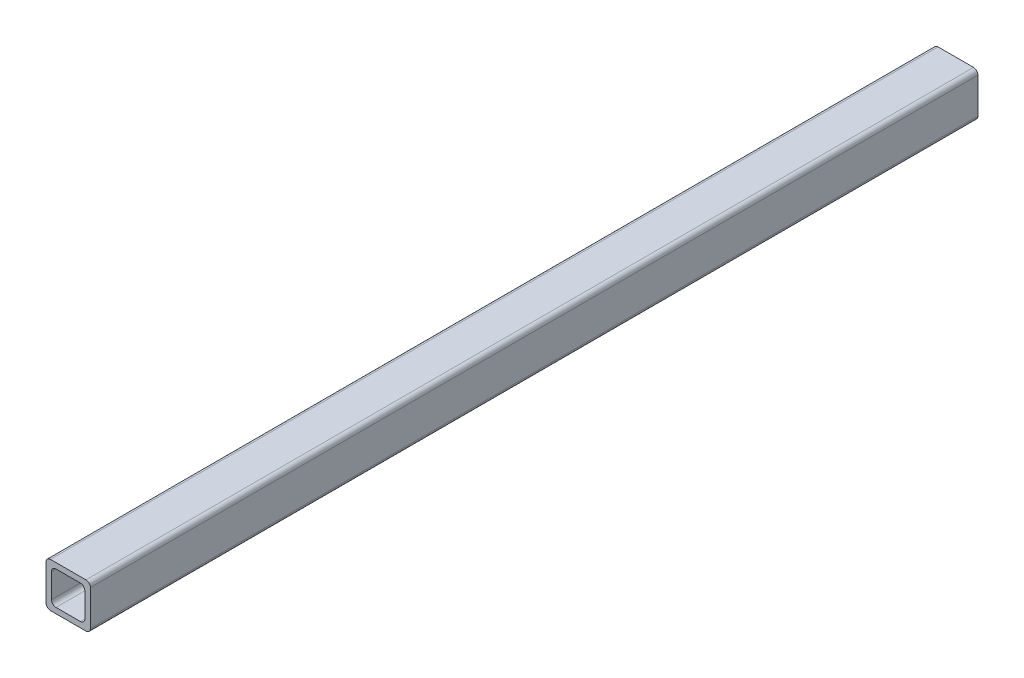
ISO-10303-21;
HEADER;
FILE_DESCRIPTION(('STEP AP214'),'2;1');
FILE_NAME('part.step','',(''),(''),'','','');
FILE_SCHEMA(('AUTOMOTIVE_DESIGN { 1 0 10303 214 1 1 1 1 }'));
ENDSEC;
DATA;
#1=APPLICATION_CONTEXT('core data for automotive mechanical design processes');
#2=APPLICATION_PROTOCOL_DEFINITION('international standard','automotive_design',2000,#1);
#3=PRODUCT_CONTEXT('',#1,'mechanical');
#4=PRODUCT('Part','Part','',(#3));
#5=PRODUCT_RELATED_PRODUCT_CATEGORY('part','',(#4));
#6=PRODUCT_DEFINITION_FORMATION('','',#4);
#7=PRODUCT_DEFINITION_CONTEXT('part definition',#1,'design');
#8=PRODUCT_DEFINITION('design','',#6,#7);
#9=PRODUCT_DEFINITION_SHAPE('','',#8);
#10=(LENGTH_UNIT() NAMED_UNIT(*) SI_UNIT(.MILLI.,.METRE.));
#11=(NAMED_UNIT(*) PLANE_ANGLE_UNIT() SI_UNIT($,.RADIAN.));
#12=(NAMED_UNIT(*) SI_UNIT($,.STERADIAN.) SOLID_ANGLE_UNIT());
#13=UNCERTAINTY_MEASURE_WITH_UNIT(LENGTH_MEASURE(1.E-05),#10,'distance_accuracy_value','');
#14=(GEOMETRIC_REPRESENTATION_CONTEXT(3) GLOBAL_UNCERTAINTY_ASSIGNED_CONTEXT((#13)) GLOBAL_UNIT_ASSIGNED_CONTEXT((#10,
#11,#12)) REPRESENTATION_CONTEXT('',''));
#15=CARTESIAN_POINT('',(0.,0.,0.));
#16=DIRECTION('',(0.,0.,1.));
#17=DIRECTION('',(1.,0.,0.));
#18=AXIS2_PLACEMENT_3D('',#15,#16,#17);
#19=CARTESIAN_POINT('',(-9.50097337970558,-8.,400.));
#20=DIRECTION('',(0.,0.,-1.));
#21=DIRECTION('',(-1.,0.,0.));
#22=AXIS2_PLACEMENT_3D('',#19,#20,#21);
#23=PLANE('',#22);
#24=CARTESIAN_POINT('',(-9.50097337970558,-8.,400.));
#25=DIRECTION('',(0.,0.,1.));
#26=DIRECTION('',(-1.,0.,0.));
#27=AXIS2_PLACEMENT_3D('',#24,#25,#26);
#28=CIRCLE('',#27,2.);
#29=CARTESIAN_POINT('',(-11.5009733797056,-7.99999999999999,400.));
#30=VERTEX_POINT('',#29);
#31=CARTESIAN_POINT('',(-9.50097337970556,-10.,400.));
#32=VERTEX_POINT('',#31);
#33=EDGE_CURVE('E211',#30,#32,#28,.T.);
#34=ORIENTED_EDGE('',*,*,#33,.T.);
#35=DIRECTION('',(1.,0.,0.));
#36=VECTOR('',#35,1.);
#37=CARTESIAN_POINT('',(6.49902662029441,-10.,400.));
#38=LINE('',#37,#36);
#39=CARTESIAN_POINT('',(6.49902662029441,-10.,400.));
#40=VERTEX_POINT('',#39);
#41=EDGE_CURVE('E214',#32,#40,#38,.T.);
#42=ORIENTED_EDGE('',*,*,#41,.T.);
#43=CARTESIAN_POINT('',(6.49902662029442,-8.,400.));
#44=DIRECTION('',(0.,0.,1.));
#45=DIRECTION('',(1.,0.,0.));
#46=AXIS2_PLACEMENT_3D('',#43,#44,#45);
#47=CIRCLE('',#46,2.);
#48=CARTESIAN_POINT('',(8.49902662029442,-7.99999999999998,400.));
#49=VERTEX_POINT('',#48);
#50=EDGE_CURVE('E217',#40,#49,#47,.T.);
#51=ORIENTED_EDGE('',*,*,#50,.T.);
#52=DIRECTION('',(0.,1.,0.));
#53=VECTOR('',#52,1.);
#54=CARTESIAN_POINT('',(8.49902662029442,-7.99999999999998,400.));
#55=LINE('',#54,#53);
#56=CARTESIAN_POINT('',(8.49902662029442,7.99999999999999,400.));
#57=VERTEX_POINT('',#56);
#58=EDGE_CURVE('E219',#49,#57,#55,.T.);
#59=ORIENTED_EDGE('',*,*,#58,.T.);
#60=CARTESIAN_POINT('',(6.49902662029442,8.,400.));
#61=DIRECTION('',(0.,0.,1.));
#62=DIRECTION('',(1.,0.,0.));
#63=AXIS2_PLACEMENT_3D('',#60,#61,#62);
#64=CIRCLE('',#63,2.);
#65=CARTESIAN_POINT('',(6.49902662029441,10.,400.));
#66=VERTEX_POINT('',#65);
#67=EDGE_CURVE('E221',#57,#66,#64,.T.);
#68=ORIENTED_EDGE('',*,*,#67,.T.);
#69=DIRECTION('',(-1.,0.,0.));
#70=VECTOR('',#69,1.);
#71=CARTESIAN_POINT('',(6.49902662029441,10.,400.));
#72=LINE('',#71,#70);
#73=CARTESIAN_POINT('',(-9.50097337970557,10.,400.));
#74=VERTEX_POINT('',#73);
#75=EDGE_CURVE('E223',#66,#74,#72,.T.);
#76=ORIENTED_EDGE('',*,*,#75,.T.);
#77=CARTESIAN_POINT('',(-9.50097337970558,8.,400.));
#78=DIRECTION('',(0.,0.,1.));
#79=DIRECTION('',(1.,0.,0.));
#80=AXIS2_PLACEMENT_3D('',#77,#78,#79);
#81=CIRCLE('',#80,2.);
#82=CARTESIAN_POINT('',(-11.5009733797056,7.99999999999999,400.));
#83=VERTEX_POINT('',#82);
#84=EDGE_CURVE('E225',#74,#83,#81,.T.);
#85=ORIENTED_EDGE('',*,*,#84,.T.);
#86=DIRECTION('',(0.,-1.,0.));
#87=VECTOR('',#86,1.);
#88=CARTESIAN_POINT('',(-11.5009733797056,-7.99999999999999,400.));
#89=LINE('',#88,#87);
#90=EDGE_CURVE('E227',#83,#30,#89,.T.);
#91=ORIENTED_EDGE('',*,*,#90,.T.);
#92=EDGE_LOOP('',(#34,#42,#51,#59,#68,#76,#85,#91));
#93=FACE_BOUND('',#92,.T.);
#94=CARTESIAN_POINT('',(3.99902662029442,-5.5,400.));
#95=DIRECTION('',(0.,0.,1.));
#96=DIRECTION('',(1.,0.,0.));
#97=AXIS2_PLACEMENT_3D('',#94,#95,#96);
#98=CIRCLE('',#97,2.);
#99=CARTESIAN_POINT('',(3.99902662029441,-7.5,400.));
#100=VERTEX_POINT('',#99);
#101=CARTESIAN_POINT('',(5.99902662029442,-5.49999999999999,400.));
#102=VERTEX_POINT('',#101);
#103=EDGE_CURVE('E146',#100,#102,#98,.T.);
#104=ORIENTED_EDGE('',*,*,#103,.F.);
#105=DIRECTION('',(1.,0.,0.));
#106=VECTOR('',#105,1.);
#107=CARTESIAN_POINT('',(3.99902662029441,-7.5,400.));
#108=LINE('',#107,#106);
#109=CARTESIAN_POINT('',(-7.00097337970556,-7.5,400.));
#110=VERTEX_POINT('',#109);
#111=EDGE_CURVE('E179',#110,#100,#108,.T.);
#112=ORIENTED_EDGE('',*,*,#111,.F.);
#113=CARTESIAN_POINT('',(-7.00097337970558,-5.5,400.));
#114=DIRECTION('',(0.,0.,1.));
#115=DIRECTION('',(1.,0.,0.));
#116=AXIS2_PLACEMENT_3D('',#113,#114,#115);
#117=CIRCLE('',#116,2.);
#118=CARTESIAN_POINT('',(-9.00097337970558,-5.49999999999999,400.));
#119=VERTEX_POINT('',#118);
#120=EDGE_CURVE('E177',#119,#110,#117,.T.);
#121=ORIENTED_EDGE('',*,*,#120,.F.);
#122=DIRECTION('',(0.,-1.,0.));
#123=VECTOR('',#122,1.);
#124=CARTESIAN_POINT('',(-9.00097337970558,-5.49999999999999,400.));
#125=LINE('',#124,#123);
#126=CARTESIAN_POINT('',(-9.00097337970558,5.49999999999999,400.));
#127=VERTEX_POINT('',#126);
#128=EDGE_CURVE('E175',#127,#119,#125,.T.);
#129=ORIENTED_EDGE('',*,*,#128,.F.);
#130=CARTESIAN_POINT('',(-7.00097337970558,5.5,400.));
#131=DIRECTION('',(0.,0.,1.));
#132=DIRECTION('',(1.,0.,0.));
#133=AXIS2_PLACEMENT_3D('',#130,#131,#132);
#134=CIRCLE('',#133,2.);
#135=CARTESIAN_POINT('',(-7.00097337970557,7.5,400.));
#136=VERTEX_POINT('',#135);
#137=EDGE_CURVE('E173',#136,#127,#134,.T.);
#138=ORIENTED_EDGE('',*,*,#137,.F.);
#139=DIRECTION('',(-1.,0.,0.));
#140=VECTOR('',#139,1.);
#141=CARTESIAN_POINT('',(3.99902662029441,7.5,400.));
#142=LINE('',#141,#140);
#143=CARTESIAN_POINT('',(3.99902662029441,7.5,400.));
#144=VERTEX_POINT('',#143);
#145=EDGE_CURVE('E169',#144,#136,#142,.T.);
#146=ORIENTED_EDGE('',*,*,#145,.F.);
#147=CARTESIAN_POINT('',(3.99902662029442,5.5,400.));
#148=DIRECTION('',(0.,0.,1.));
#149=DIRECTION('',(-1.,0.,0.));
#150=AXIS2_PLACEMENT_3D('',#147,#148,#149);
#151=CIRCLE('',#150,2.);
#152=CARTESIAN_POINT('',(5.99902662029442,5.49999999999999,400.));
#153=VERTEX_POINT('',#152);
#154=EDGE_CURVE('E167',#153,#144,#151,.T.);
#155=ORIENTED_EDGE('',*,*,#154,.F.);
#156=DIRECTION('',(0.,1.,0.));
#157=VECTOR('',#156,1.);
#158=CARTESIAN_POINT('',(5.99902662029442,-5.49999999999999,400.));
#159=LINE('',#158,#157);
#160=EDGE_CURVE('E154',#102,#153,#159,.T.);
#161=ORIENTED_EDGE('',*,*,#160,.F.);
#162=EDGE_LOOP('',(#104,#112,#121,#129,#138,#146,#155,#161));
#163=FACE_BOUND('',#162,.T.);
#164=ADVANCED_FACE('F33',(#93,#163),#23,.F.);
#165=CARTESIAN_POINT('',(-9.50097337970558,-8.,0.));
#166=DIRECTION('',(0.,0.,-1.));
#167=DIRECTION('',(-1.,0.,0.));
#168=AXIS2_PLACEMENT_3D('',#165,#166,#167);
#169=PLANE('',#168);
#170=CARTESIAN_POINT('',(-9.50097337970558,-8.,0.));
#171=DIRECTION('',(0.,0.,1.));
#172=DIRECTION('',(-1.,0.,0.));
#173=AXIS2_PLACEMENT_3D('',#170,#171,#172);
#174=CIRCLE('',#173,2.);
#175=CARTESIAN_POINT('',(-11.5009733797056,-7.99999999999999,0.));
#176=VERTEX_POINT('',#175);
#177=CARTESIAN_POINT('',(-9.50097337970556,-10.,0.));
#178=VERTEX_POINT('',#177);
#179=EDGE_CURVE('E162',#176,#178,#174,.T.);
#180=ORIENTED_EDGE('',*,*,#179,.F.);
#181=DIRECTION('',(0.,-1.,0.));
#182=VECTOR('',#181,1.);
#183=CARTESIAN_POINT('',(-11.5009733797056,-7.99999999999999,0.));
#184=LINE('',#183,#182);
#185=CARTESIAN_POINT('',(-11.5009733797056,7.99999999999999,0.));
#186=VERTEX_POINT('',#185);
#187=EDGE_CURVE('E215',#186,#176,#184,.T.);
#188=ORIENTED_EDGE('',*,*,#187,.F.);
#189=CARTESIAN_POINT('',(-9.50097337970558,8.,0.));
#190=DIRECTION('',(0.,0.,1.));
#191=DIRECTION('',(1.,0.,0.));
#192=AXIS2_PLACEMENT_3D('',#189,#190,#191);
#193=CIRCLE('',#192,2.);
#194=CARTESIAN_POINT('',(-9.50097337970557,10.,0.));
#195=VERTEX_POINT('',#194);
#196=EDGE_CURVE('E242',#195,#186,#193,.T.);
#197=ORIENTED_EDGE('',*,*,#196,.F.);
#198=DIRECTION('',(-1.,0.,0.));
#199=VECTOR('',#198,1.);
#200=CARTESIAN_POINT('',(6.49902662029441,10.,0.));
#201=LINE('',#200,#199);
#202=CARTESIAN_POINT('',(6.49902662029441,10.,0.));
#203=VERTEX_POINT('',#202);
#204=EDGE_CURVE('E240',#203,#195,#201,.T.);
#205=ORIENTED_EDGE('',*,*,#204,.F.);
#206=CARTESIAN_POINT('',(6.49902662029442,8.,0.));
#207=DIRECTION('',(0.,0.,1.));
#208=DIRECTION('',(1.,0.,0.));
#209=AXIS2_PLACEMENT_3D('',#206,#207,#208);
#210=CIRCLE('',#209,2.);
#211=CARTESIAN_POINT('',(8.49902662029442,7.99999999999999,0.));
#212=VERTEX_POINT('',#211);
#213=EDGE_CURVE('E238',#212,#203,#210,.T.);
#214=ORIENTED_EDGE('',*,*,#213,.F.);
#215=DIRECTION('',(0.,1.,0.));
#216=VECTOR('',#215,1.);
#217=CARTESIAN_POINT('',(8.49902662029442,-7.99999999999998,0.));
#218=LINE('',#217,#216);
#219=CARTESIAN_POINT('',(8.49902662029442,-7.99999999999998,0.));
#220=VERTEX_POINT('',#219);
#221=EDGE_CURVE('E236',#220,#212,#218,.T.);
#222=ORIENTED_EDGE('',*,*,#221,.F.);
#223=CARTESIAN_POINT('',(6.49902662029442,-8.,0.));
#224=DIRECTION('',(0.,0.,1.));
#225=DIRECTION('',(1.,0.,0.));
#226=AXIS2_PLACEMENT_3D('',#223,#224,#225);
#227=CIRCLE('',#226,2.);
#228=CARTESIAN_POINT('',(6.49902662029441,-10.,0.));
#229=VERTEX_POINT('',#228);
#230=EDGE_CURVE('E234',#229,#220,#227,.T.);
#231=ORIENTED_EDGE('',*,*,#230,.F.);
#232=DIRECTION('',(1.,0.,0.));
#233=VECTOR('',#232,1.);
#234=CARTESIAN_POINT('',(6.49902662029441,-10.,0.));
#235=LINE('',#234,#233);
#236=EDGE_CURVE('E232',#178,#229,#235,.T.);
#237=ORIENTED_EDGE('',*,*,#236,.F.);
#238=EDGE_LOOP('',(#180,#188,#197,#205,#214,#222,#231,#237));
#239=FACE_BOUND('',#238,.T.);
#240=DIRECTION('',(1.,0.,0.));
#241=VECTOR('',#240,1.);
#242=CARTESIAN_POINT('',(3.99902662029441,-7.5,0.));
#243=LINE('',#242,#241);
#244=CARTESIAN_POINT('',(-7.00097337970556,-7.5,0.));
#245=VERTEX_POINT('',#244);
#246=CARTESIAN_POINT('',(3.99902662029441,-7.5,0.));
#247=VERTEX_POINT('',#246);
#248=EDGE_CURVE('E155',#245,#247,#243,.T.);
#249=ORIENTED_EDGE('',*,*,#248,.T.);
#250=CARTESIAN_POINT('',(3.99902662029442,-5.5,0.));
#251=DIRECTION('',(0.,0.,1.));
#252=DIRECTION('',(1.,0.,0.));
#253=AXIS2_PLACEMENT_3D('',#250,#251,#252);
#254=CIRCLE('',#253,2.);
#255=CARTESIAN_POINT('',(5.99902662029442,-5.49999999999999,0.));
#256=VERTEX_POINT('',#255);
#257=EDGE_CURVE('E56',#247,#256,#254,.T.);
#258=ORIENTED_EDGE('',*,*,#257,.T.);
#259=DIRECTION('',(0.,1.,0.));
#260=VECTOR('',#259,1.);
#261=CARTESIAN_POINT('',(5.99902662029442,-5.49999999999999,0.));
#262=LINE('',#261,#260);
#263=CARTESIAN_POINT('',(5.99902662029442,5.49999999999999,0.));
#264=VERTEX_POINT('',#263);
#265=EDGE_CURVE('E161',#256,#264,#262,.T.);
#266=ORIENTED_EDGE('',*,*,#265,.T.);
#267=CARTESIAN_POINT('',(3.99902662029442,5.5,0.));
#268=DIRECTION('',(0.,0.,1.));
#269=DIRECTION('',(-1.,0.,0.));
#270=AXIS2_PLACEMENT_3D('',#267,#268,#269);
#271=CIRCLE('',#270,2.);
#272=CARTESIAN_POINT('',(3.99902662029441,7.5,0.));
#273=VERTEX_POINT('',#272);
#274=EDGE_CURVE('E183',#264,#273,#271,.T.);
#275=ORIENTED_EDGE('',*,*,#274,.T.);
#276=DIRECTION('',(-1.,0.,0.));
#277=VECTOR('',#276,1.);
#278=CARTESIAN_POINT('',(3.99902662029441,7.5,0.));
#279=LINE('',#278,#277);
#280=CARTESIAN_POINT('',(-7.00097337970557,7.5,0.));
#281=VERTEX_POINT('',#280);
#282=EDGE_CURVE('E186',#273,#281,#279,.T.);
#283=ORIENTED_EDGE('',*,*,#282,.T.);
#284=CARTESIAN_POINT('',(-7.00097337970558,5.5,0.));
#285=DIRECTION('',(0.,0.,1.));
#286=DIRECTION('',(1.,0.,0.));
#287=AXIS2_PLACEMENT_3D('',#284,#285,#286);
#288=CIRCLE('',#287,2.);
#289=CARTESIAN_POINT('',(-9.00097337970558,5.49999999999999,0.));
#290=VERTEX_POINT('',#289);
#291=EDGE_CURVE('E189',#281,#290,#288,.T.);
#292=ORIENTED_EDGE('',*,*,#291,.T.);
#293=DIRECTION('',(0.,-1.,0.));
#294=VECTOR('',#293,1.);
#295=CARTESIAN_POINT('',(-9.00097337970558,-5.49999999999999,0.));
#296=LINE('',#295,#294);
#297=CARTESIAN_POINT('',(-9.00097337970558,-5.49999999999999,0.));
#298=VERTEX_POINT('',#297);
#299=EDGE_CURVE('E192',#290,#298,#296,.T.);
#300=ORIENTED_EDGE('',*,*,#299,.T.);
#301=CARTESIAN_POINT('',(-7.00097337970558,-5.5,0.));
#302=DIRECTION('',(0.,0.,1.));
#303=DIRECTION('',(1.,0.,0.));
#304=AXIS2_PLACEMENT_3D('',#301,#302,#303);
#305=CIRCLE('',#304,2.);
#306=EDGE_CURVE('E195',#298,#245,#305,.T.);
#307=ORIENTED_EDGE('',*,*,#306,.T.);
#308=EDGE_LOOP('',(#249,#258,#266,#275,#283,#292,#300,#307));
#309=FACE_BOUND('',#308,.T.);
#310=ADVANCED_FACE('F272',(#239,#309),#169,.T.);
#311=CARTESIAN_POINT('',(-9.50097337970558,-8.,400.));
#312=DIRECTION('',(0.,0.,-1.));
#313=DIRECTION('',(-1.,0.,0.));
#314=AXIS2_PLACEMENT_3D('',#311,#312,#313);
#315=CYLINDRICAL_SURFACE('',#314,2.);
#316=ORIENTED_EDGE('',*,*,#179,.T.);
#317=DIRECTION('',(0.,0.,-1.));
#318=VECTOR('',#317,1.);
#319=CARTESIAN_POINT('',(-9.50097337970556,-10.,400.));
#320=LINE('',#319,#318);
#321=EDGE_CURVE('E11',#32,#178,#320,.T.);
#322=ORIENTED_EDGE('',*,*,#321,.F.);
#323=ORIENTED_EDGE('',*,*,#33,.F.);
#324=DIRECTION('',(0.,0.,-1.));
#325=VECTOR('',#324,1.);
#326=CARTESIAN_POINT('',(-11.5009733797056,-7.99999999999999,400.));
#327=LINE('',#326,#325);
#328=EDGE_CURVE('E229',#30,#176,#327,.T.);
#329=ORIENTED_EDGE('',*,*,#328,.T.);
#330=EDGE_LOOP('',(#316,#322,#323,#329));
#331=FACE_BOUND('',#330,.T.);
#332=ADVANCED_FACE('F35',(#331),#315,.T.);
#333=CARTESIAN_POINT('',(6.49902662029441,-10.,400.));
#334=DIRECTION('',(0.,1.,0.));
#335=DIRECTION('',(-1.,0.,0.));
#336=AXIS2_PLACEMENT_3D('',#333,#334,#335);
#337=PLANE('',#336);
#338=ORIENTED_EDGE('',*,*,#236,.T.);
#339=DIRECTION('',(0.,0.,-1.));
#340=VECTOR('',#339,1.);
#341=CARTESIAN_POINT('',(6.49902662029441,-10.,400.));
#342=LINE('',#341,#340);
#343=EDGE_CURVE('E41',#40,#229,#342,.T.);
#344=ORIENTED_EDGE('',*,*,#343,.F.);
#345=ORIENTED_EDGE('',*,*,#41,.F.);
#346=ORIENTED_EDGE('',*,*,#321,.T.);
#347=EDGE_LOOP('',(#338,#344,#345,#346));
#348=FACE_BOUND('',#347,.T.);
#349=ADVANCED_FACE('F289',(#348),#337,.F.);
#350=CARTESIAN_POINT('',(6.49902662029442,-8.,400.));
#351=DIRECTION('',(0.,0.,-1.));
#352=DIRECTION('',(-1.,0.,0.));
#353=AXIS2_PLACEMENT_3D('',#350,#351,#352);
#354=CYLINDRICAL_SURFACE('',#353,2.);
#355=ORIENTED_EDGE('',*,*,#230,.T.);
#356=DIRECTION('',(0.,0.,-1.));
#357=VECTOR('',#356,1.);
#358=CARTESIAN_POINT('',(8.49902662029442,-7.99999999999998,400.));
#359=LINE('',#358,#357);
#360=EDGE_CURVE('E259',#49,#220,#359,.T.);
#361=ORIENTED_EDGE('',*,*,#360,.F.);
#362=ORIENTED_EDGE('',*,*,#50,.F.);
#363=ORIENTED_EDGE('',*,*,#343,.T.);
#364=EDGE_LOOP('',(#355,#361,#362,#363));
#365=FACE_BOUND('',#364,.T.);
#366=ADVANCED_FACE('F266',(#365),#354,.T.);
#367=CARTESIAN_POINT('',(8.49902662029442,-7.99999999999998,400.));
#368=DIRECTION('',(-1.,0.,0.));
#369=DIRECTION('',(0.,0.,1.));
#370=AXIS2_PLACEMENT_3D('',#367,#368,#369);
#371=PLANE('',#370);
#372=ORIENTED_EDGE('',*,*,#221,.T.);
#373=DIRECTION('',(0.,0.,-1.));
#374=VECTOR('',#373,1.);
#375=CARTESIAN_POINT('',(8.49902662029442,7.99999999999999,400.));
#376=LINE('',#375,#374);
#377=EDGE_CURVE('E256',#57,#212,#376,.T.);
#378=ORIENTED_EDGE('',*,*,#377,.F.);
#379=ORIENTED_EDGE('',*,*,#58,.F.);
#380=ORIENTED_EDGE('',*,*,#360,.T.);
#381=EDGE_LOOP('',(#372,#378,#379,#380));
#382=FACE_BOUND('',#381,.T.);
#383=ADVANCED_FACE('F278',(#382),#371,.F.);
#384=CARTESIAN_POINT('',(6.49902662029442,8.,400.));
#385=DIRECTION('',(0.,0.,-1.));
#386=DIRECTION('',(-1.,0.,0.));
#387=AXIS2_PLACEMENT_3D('',#384,#385,#386);
#388=CYLINDRICAL_SURFACE('',#387,2.);
#389=ORIENTED_EDGE('',*,*,#213,.T.);
#390=DIRECTION('',(0.,0.,-1.));
#391=VECTOR('',#390,1.);
#392=CARTESIAN_POINT('',(6.49902662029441,10.,400.));
#393=LINE('',#392,#391);
#394=EDGE_CURVE('E253',#66,#203,#393,.T.);
#395=ORIENTED_EDGE('',*,*,#394,.F.);
#396=ORIENTED_EDGE('',*,*,#67,.F.);
#397=ORIENTED_EDGE('',*,*,#377,.T.);
#398=EDGE_LOOP('',(#389,#395,#396,#397));
#399=FACE_BOUND('',#398,.T.);
#400=ADVANCED_FACE('F282',(#399),#388,.T.);
#401=CARTESIAN_POINT('',(6.49902662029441,10.,400.));
#402=DIRECTION('',(0.,-1.,0.));
#403=DIRECTION('',(1.,0.,0.));
#404=AXIS2_PLACEMENT_3D('',#401,#402,#403);
#405=PLANE('',#404);
#406=ORIENTED_EDGE('',*,*,#204,.T.);
#407=DIRECTION('',(0.,0.,-1.));
#408=VECTOR('',#407,1.);
#409=CARTESIAN_POINT('',(-9.50097337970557,10.,400.));
#410=LINE('',#409,#408);
#411=EDGE_CURVE('E250',#74,#195,#410,.T.);
#412=ORIENTED_EDGE('',*,*,#411,.F.);
#413=ORIENTED_EDGE('',*,*,#75,.F.);
#414=ORIENTED_EDGE('',*,*,#394,.T.);
#415=EDGE_LOOP('',(#406,#412,#413,#414));
#416=FACE_BOUND('',#415,.T.);
#417=ADVANCED_FACE('F302',(#416),#405,.F.);
#418=CARTESIAN_POINT('',(-9.50097337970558,8.,400.));
#419=DIRECTION('',(0.,0.,-1.));
#420=DIRECTION('',(-1.,0.,0.));
#421=AXIS2_PLACEMENT_3D('',#418,#419,#420);
#422=CYLINDRICAL_SURFACE('',#421,2.);
#423=ORIENTED_EDGE('',*,*,#196,.T.);
#424=DIRECTION('',(0.,0.,-1.));
#425=VECTOR('',#424,1.);
#426=CARTESIAN_POINT('',(-11.5009733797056,7.99999999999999,400.));
#427=LINE('',#426,#425);
#428=EDGE_CURVE('E247',#83,#186,#427,.T.);
#429=ORIENTED_EDGE('',*,*,#428,.F.);
#430=ORIENTED_EDGE('',*,*,#84,.F.);
#431=ORIENTED_EDGE('',*,*,#411,.T.);
#432=EDGE_LOOP('',(#423,#429,#430,#431));
#433=FACE_BOUND('',#432,.T.);
#434=ADVANCED_FACE('F300',(#433),#422,.T.);
#435=CARTESIAN_POINT('',(-11.5009733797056,-7.99999999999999,400.));
#436=DIRECTION('',(1.,0.,0.));
#437=DIRECTION('',(0.,0.,-1.));
#438=AXIS2_PLACEMENT_3D('',#435,#436,#437);
#439=PLANE('',#438);
#440=ORIENTED_EDGE('',*,*,#187,.T.);
#441=ORIENTED_EDGE('',*,*,#328,.F.);
#442=ORIENTED_EDGE('',*,*,#90,.F.);
#443=ORIENTED_EDGE('',*,*,#428,.T.);
#444=EDGE_LOOP('',(#440,#441,#442,#443));
#445=FACE_BOUND('',#444,.T.);
#446=ADVANCED_FACE('F295',(#445),#439,.F.);
#447=CARTESIAN_POINT('',(3.99902662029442,-5.5,400.));
#448=DIRECTION('',(0.,0.,-1.));
#449=DIRECTION('',(-1.,0.,0.));
#450=AXIS2_PLACEMENT_3D('',#447,#448,#449);
#451=CYLINDRICAL_SURFACE('',#450,2.);
#452=ORIENTED_EDGE('',*,*,#257,.F.);
#453=DIRECTION('',(0.,0.,-1.));
#454=VECTOR('',#453,1.);
#455=CARTESIAN_POINT('',(3.99902662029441,-7.5,400.));
#456=LINE('',#455,#454);
#457=EDGE_CURVE('E150',#100,#247,#456,.T.);
#458=ORIENTED_EDGE('',*,*,#457,.F.);
#459=ORIENTED_EDGE('',*,*,#103,.T.);
#460=DIRECTION('',(0.,0.,-1.));
#461=VECTOR('',#460,1.);
#462=CARTESIAN_POINT('',(5.99902662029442,-5.49999999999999,400.));
#463=LINE('',#462,#461);
#464=EDGE_CURVE('E149',#102,#256,#463,.T.);
#465=ORIENTED_EDGE('',*,*,#464,.T.);
#466=EDGE_LOOP('',(#452,#458,#459,#465));
#467=FACE_BOUND('',#466,.T.);
#468=ADVANCED_FACE('F148',(#467),#451,.F.);
#469=CARTESIAN_POINT('',(5.99902662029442,-5.49999999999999,400.));
#470=DIRECTION('',(-1.,0.,0.));
#471=DIRECTION('',(0.,0.,1.));
#472=AXIS2_PLACEMENT_3D('',#469,#470,#471);
#473=PLANE('',#472);
#474=ORIENTED_EDGE('',*,*,#265,.F.);
#475=ORIENTED_EDGE('',*,*,#464,.F.);
#476=ORIENTED_EDGE('',*,*,#160,.T.);
#477=DIRECTION('',(0.,0.,-1.));
#478=VECTOR('',#477,1.);
#479=CARTESIAN_POINT('',(5.99902662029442,5.49999999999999,400.));
#480=LINE('',#479,#478);
#481=EDGE_CURVE('E163',#153,#264,#480,.T.);
#482=ORIENTED_EDGE('',*,*,#481,.T.);
#483=EDGE_LOOP('',(#474,#475,#476,#482));
#484=FACE_BOUND('',#483,.T.);
#485=ADVANCED_FACE('F158',(#484),#473,.T.);
#486=CARTESIAN_POINT('',(3.99902662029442,5.5,400.));
#487=DIRECTION('',(0.,0.,-1.));
#488=DIRECTION('',(-1.,0.,0.));
#489=AXIS2_PLACEMENT_3D('',#486,#487,#488);
#490=CYLINDRICAL_SURFACE('',#489,2.);
#491=ORIENTED_EDGE('',*,*,#274,.F.);
#492=ORIENTED_EDGE('',*,*,#481,.F.);
#493=ORIENTED_EDGE('',*,*,#154,.T.);
#494=DIRECTION('',(0.,0.,-1.));
#495=VECTOR('',#494,1.);
#496=CARTESIAN_POINT('',(3.99902662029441,7.5,400.));
#497=LINE('',#496,#495);
#498=EDGE_CURVE('E208',#144,#273,#497,.T.);
#499=ORIENTED_EDGE('',*,*,#498,.T.);
#500=EDGE_LOOP('',(#491,#492,#493,#499));
#501=FACE_BOUND('',#500,.T.);
#502=ADVANCED_FACE('F327',(#501),#490,.F.);
#503=CARTESIAN_POINT('',(3.99902662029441,7.5,400.));
#504=DIRECTION('',(0.,-1.,0.));
#505=DIRECTION('',(1.,0.,0.));
#506=AXIS2_PLACEMENT_3D('',#503,#504,#505);
#507=PLANE('',#506);
#508=ORIENTED_EDGE('',*,*,#282,.F.);
#509=ORIENTED_EDGE('',*,*,#498,.F.);
#510=ORIENTED_EDGE('',*,*,#145,.T.);
#511=DIRECTION('',(0.,0.,-1.));
#512=VECTOR('',#511,1.);
#513=CARTESIAN_POINT('',(-7.00097337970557,7.5,400.));
#514=LINE('',#513,#512);
#515=EDGE_CURVE('E206',#136,#281,#514,.T.);
#516=ORIENTED_EDGE('',*,*,#515,.T.);
#517=EDGE_LOOP('',(#508,#509,#510,#516));
#518=FACE_BOUND('',#517,.T.);
#519=ADVANCED_FACE('F331',(#518),#507,.T.);
#520=CARTESIAN_POINT('',(-7.00097337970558,5.5,400.));
#521=DIRECTION('',(0.,0.,-1.));
#522=DIRECTION('',(-1.,0.,0.));
#523=AXIS2_PLACEMENT_3D('',#520,#521,#522);
#524=CYLINDRICAL_SURFACE('',#523,2.);
#525=ORIENTED_EDGE('',*,*,#291,.F.);
#526=ORIENTED_EDGE('',*,*,#515,.F.);
#527=ORIENTED_EDGE('',*,*,#137,.T.);
#528=DIRECTION('',(0.,0.,-1.));
#529=VECTOR('',#528,1.);
#530=CARTESIAN_POINT('',(-9.00097337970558,5.49999999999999,400.));
#531=LINE('',#530,#529);
#532=EDGE_CURVE('E204',#127,#290,#531,.T.);
#533=ORIENTED_EDGE('',*,*,#532,.T.);
#534=EDGE_LOOP('',(#525,#526,#527,#533));
#535=FACE_BOUND('',#534,.T.);
#536=ADVANCED_FACE('F337',(#535),#524,.F.);
#537=CARTESIAN_POINT('',(-9.00097337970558,-5.49999999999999,400.));
#538=DIRECTION('',(1.,0.,0.));
#539=DIRECTION('',(0.,1.,0.));
#540=AXIS2_PLACEMENT_3D('',#537,#538,#539);
#541=PLANE('',#540);
#542=ORIENTED_EDGE('',*,*,#299,.F.);
#543=ORIENTED_EDGE('',*,*,#532,.F.);
#544=ORIENTED_EDGE('',*,*,#128,.T.);
#545=DIRECTION('',(0.,0.,-1.));
#546=VECTOR('',#545,1.);
#547=CARTESIAN_POINT('',(-9.00097337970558,-5.49999999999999,400.));
#548=LINE('',#547,#546);
#549=EDGE_CURVE('E202',#119,#298,#548,.T.);
#550=ORIENTED_EDGE('',*,*,#549,.T.);
#551=EDGE_LOOP('',(#542,#543,#544,#550));
#552=FACE_BOUND('',#551,.T.);
#553=ADVANCED_FACE('F341',(#552),#541,.T.);
#554=CARTESIAN_POINT('',(-7.00097337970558,-5.5,400.));
#555=DIRECTION('',(0.,0.,-1.));
#556=DIRECTION('',(-1.,0.,0.));
#557=AXIS2_PLACEMENT_3D('',#554,#555,#556);
#558=CYLINDRICAL_SURFACE('',#557,2.);
#559=ORIENTED_EDGE('',*,*,#306,.F.);
#560=ORIENTED_EDGE('',*,*,#549,.F.);
#561=ORIENTED_EDGE('',*,*,#120,.T.);
#562=DIRECTION('',(0.,0.,-1.));
#563=VECTOR('',#562,1.);
#564=CARTESIAN_POINT('',(-7.00097337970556,-7.5,400.));
#565=LINE('',#564,#563);
#566=EDGE_CURVE('E48',#110,#245,#565,.T.);
#567=ORIENTED_EDGE('',*,*,#566,.T.);
#568=EDGE_LOOP('',(#559,#560,#561,#567));
#569=FACE_BOUND('',#568,.T.);
#570=ADVANCED_FACE('F345',(#569),#558,.F.);
#571=CARTESIAN_POINT('',(3.99902662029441,-7.5,400.));
#572=DIRECTION('',(0.,1.,0.));
#573=DIRECTION('',(0.,0.,1.));
#574=AXIS2_PLACEMENT_3D('',#571,#572,#573);
#575=PLANE('',#574);
#576=ORIENTED_EDGE('',*,*,#248,.F.);
#577=ORIENTED_EDGE('',*,*,#566,.F.);
#578=ORIENTED_EDGE('',*,*,#111,.T.);
#579=ORIENTED_EDGE('',*,*,#457,.T.);
#580=EDGE_LOOP('',(#576,#577,#578,#579));
#581=FACE_BOUND('',#580,.T.);
#582=ADVANCED_FACE('F349',(#581),#575,.T.);
#583=CLOSED_SHELL('',(#164,#310,#332,#349,#366,#383,#400,#417,#434,#446,#468,#485,#502,#519,
#536,#553,#570,#582));
#584=MANIFOLD_SOLID_BREP('B2',#583);
#585=ADVANCED_BREP_SHAPE_REPRESENTATION('',(#18,#584),#14);
#586=SHAPE_DEFINITION_REPRESENTATION(#9,#585);
ENDSEC;
END-ISO-10303-21;
